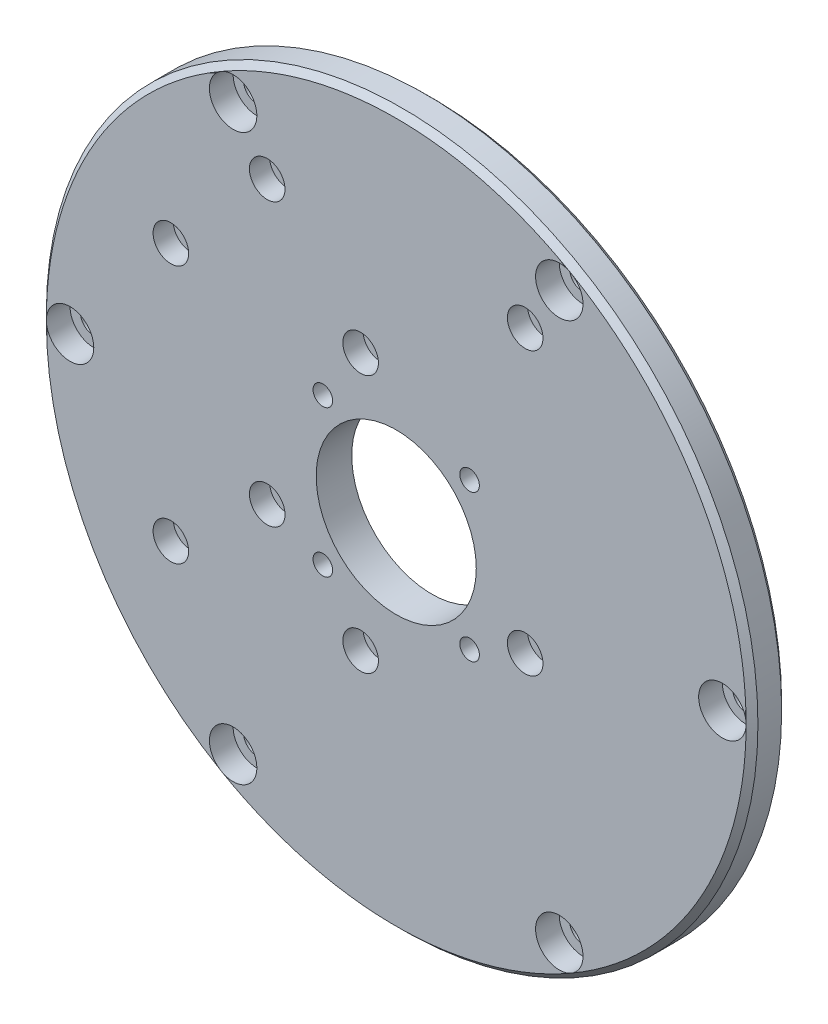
ISO-10303-21;
HEADER;
FILE_DESCRIPTION(('STEP AP214'),'2;1');
FILE_NAME('part.step','',(''),(''),'','','');
FILE_SCHEMA(('AUTOMOTIVE_DESIGN { 1 0 10303 214 1 1 1 1 }'));
ENDSEC;
DATA;
#1=APPLICATION_CONTEXT('core data for automotive mechanical design processes');
#2=APPLICATION_PROTOCOL_DEFINITION('international standard','automotive_design',2000,#1);
#3=PRODUCT_CONTEXT('',#1,'mechanical');
#4=PRODUCT('Part','Part','',(#3));
#5=PRODUCT_RELATED_PRODUCT_CATEGORY('part','',(#4));
#6=PRODUCT_DEFINITION_FORMATION('','',#4);
#7=PRODUCT_DEFINITION_CONTEXT('part definition',#1,'design');
#8=PRODUCT_DEFINITION('design','',#6,#7);
#9=PRODUCT_DEFINITION_SHAPE('','',#8);
#10=(LENGTH_UNIT() NAMED_UNIT(*) SI_UNIT(.MILLI.,.METRE.));
#11=(NAMED_UNIT(*) PLANE_ANGLE_UNIT() SI_UNIT($,.RADIAN.));
#12=(NAMED_UNIT(*) SI_UNIT($,.STERADIAN.) SOLID_ANGLE_UNIT());
#13=UNCERTAINTY_MEASURE_WITH_UNIT(LENGTH_MEASURE(1.E-05),#10,'distance_accuracy_value','');
#14=(GEOMETRIC_REPRESENTATION_CONTEXT(3) GLOBAL_UNCERTAINTY_ASSIGNED_CONTEXT((#13)) GLOBAL_UNIT_ASSIGNED_CONTEXT((#10,
#11,#12)) REPRESENTATION_CONTEXT('',''));
#15=CARTESIAN_POINT('',(0.,0.,0.));
#16=DIRECTION('',(0.,0.,1.));
#17=DIRECTION('',(1.,0.,0.));
#18=AXIS2_PLACEMENT_3D('',#15,#16,#17);
#19=CARTESIAN_POINT('',(-4.3,-21.75,2.6));
#20=DIRECTION('',(0.,0.,-1.));
#21=DIRECTION('',(0.,-1.,0.));
#22=AXIS2_PLACEMENT_3D('',#19,#20,#21);
#23=PLANE('',#22);
#24=CARTESIAN_POINT('',(-6.,-21.75,2.6));
#25=DIRECTION('',(0.,0.,1.));
#26=DIRECTION('',(1.,0.,0.));
#27=AXIS2_PLACEMENT_3D('',#24,#25,#26);
#28=CIRCLE('',#27,1.7);
#29=CARTESIAN_POINT('',(-4.3,-21.75,2.6));
#30=VERTEX_POINT('',#29);
#31=EDGE_CURVE('E591',#30,#30,#28,.T.);
#32=ORIENTED_EDGE('',*,*,#31,.F.);
#33=EDGE_LOOP('',(#32));
#34=FACE_BOUND('',#33,.T.);
#35=CARTESIAN_POINT('',(-6.,-21.75,2.6));
#36=DIRECTION('',(0.,0.,1.));
#37=DIRECTION('',(1.,0.,0.));
#38=AXIS2_PLACEMENT_3D('',#35,#36,#37);
#39=CIRCLE('',#38,3.);
#40=CARTESIAN_POINT('',(-3.,-21.75,2.6));
#41=VERTEX_POINT('',#40);
#42=EDGE_CURVE('E1509',#41,#41,#39,.T.);
#43=ORIENTED_EDGE('',*,*,#42,.T.);
#44=EDGE_LOOP('',(#43));
#45=FACE_BOUND('',#44,.T.);
#46=ADVANCED_FACE('F17',(#34,#45),#23,.F.);
#47=CARTESIAN_POINT('',(-36.3,-21.75,2.6));
#48=DIRECTION('',(0.,0.,-1.));
#49=DIRECTION('',(0.,-1.,0.));
#50=AXIS2_PLACEMENT_3D('',#47,#48,#49);
#51=PLANE('',#50);
#52=CARTESIAN_POINT('',(-38.,-21.75,2.6));
#53=DIRECTION('',(0.,0.,1.));
#54=DIRECTION('',(1.,0.,0.));
#55=AXIS2_PLACEMENT_3D('',#52,#53,#54);
#56=CIRCLE('',#55,1.7);
#57=CARTESIAN_POINT('',(-36.3,-21.75,2.6));
#58=VERTEX_POINT('',#57);
#59=EDGE_CURVE('E575',#58,#58,#56,.T.);
#60=ORIENTED_EDGE('',*,*,#59,.F.);
#61=EDGE_LOOP('',(#60));
#62=FACE_BOUND('',#61,.T.);
#63=CARTESIAN_POINT('',(-38.,-21.75,2.6));
#64=DIRECTION('',(0.,0.,1.));
#65=DIRECTION('',(1.,0.,0.));
#66=AXIS2_PLACEMENT_3D('',#63,#64,#65);
#67=CIRCLE('',#66,3.);
#68=CARTESIAN_POINT('',(-35.,-21.75,2.6));
#69=VERTEX_POINT('',#68);
#70=EDGE_CURVE('E588',#69,#69,#67,.T.);
#71=ORIENTED_EDGE('',*,*,#70,.T.);
#72=EDGE_LOOP('',(#71));
#73=FACE_BOUND('',#72,.T.);
#74=ADVANCED_FACE('F370',(#62,#73),#51,.F.);
#75=CARTESIAN_POINT('',(-36.3,21.75,2.6));
#76=DIRECTION('',(0.,0.,-1.));
#77=DIRECTION('',(0.,-1.,0.));
#78=AXIS2_PLACEMENT_3D('',#75,#76,#77);
#79=PLANE('',#78);
#80=CARTESIAN_POINT('',(-38.,21.75,2.6));
#81=DIRECTION('',(0.,0.,1.));
#82=DIRECTION('',(1.,0.,0.));
#83=AXIS2_PLACEMENT_3D('',#80,#81,#82);
#84=CIRCLE('',#83,1.7);
#85=CARTESIAN_POINT('',(-36.3,21.75,2.6));
#86=VERTEX_POINT('',#85);
#87=EDGE_CURVE('E286',#86,#86,#84,.T.);
#88=ORIENTED_EDGE('',*,*,#87,.F.);
#89=EDGE_LOOP('',(#88));
#90=FACE_BOUND('',#89,.T.);
#91=CARTESIAN_POINT('',(-38.,21.75,2.6));
#92=DIRECTION('',(0.,0.,1.));
#93=DIRECTION('',(1.,0.,0.));
#94=AXIS2_PLACEMENT_3D('',#91,#92,#93);
#95=CIRCLE('',#94,3.);
#96=CARTESIAN_POINT('',(-35.,21.75,2.6));
#97=VERTEX_POINT('',#96);
#98=EDGE_CURVE('E341',#97,#97,#95,.T.);
#99=ORIENTED_EDGE('',*,*,#98,.T.);
#100=EDGE_LOOP('',(#99));
#101=FACE_BOUND('',#100,.T.);
#102=ADVANCED_FACE('F376',(#90,#101),#79,.F.);
#103=CARTESIAN_POINT('',(-4.3,21.75,2.6));
#104=DIRECTION('',(0.,0.,-1.));
#105=DIRECTION('',(0.,-1.,0.));
#106=AXIS2_PLACEMENT_3D('',#103,#104,#105);
#107=PLANE('',#106);
#108=CARTESIAN_POINT('',(-6.,21.75,2.6));
#109=DIRECTION('',(0.,0.,1.));
#110=DIRECTION('',(1.,0.,0.));
#111=AXIS2_PLACEMENT_3D('',#108,#109,#110);
#112=CIRCLE('',#111,1.7);
#113=CARTESIAN_POINT('',(-4.3,21.75,2.6));
#114=VERTEX_POINT('',#113);
#115=EDGE_CURVE('E309',#114,#114,#112,.T.);
#116=ORIENTED_EDGE('',*,*,#115,.F.);
#117=EDGE_LOOP('',(#116));
#118=FACE_BOUND('',#117,.T.);
#119=CARTESIAN_POINT('',(-6.,21.75,2.6));
#120=DIRECTION('',(0.,0.,1.));
#121=DIRECTION('',(1.,0.,0.));
#122=AXIS2_PLACEMENT_3D('',#119,#120,#121);
#123=CIRCLE('',#122,3.);
#124=CARTESIAN_POINT('',(-3.,21.75,2.6));
#125=VERTEX_POINT('',#124);
#126=EDGE_CURVE('E290',#125,#125,#123,.T.);
#127=ORIENTED_EDGE('',*,*,#126,.T.);
#128=EDGE_LOOP('',(#127));
#129=FACE_BOUND('',#128,.T.);
#130=ADVANCED_FACE('F19',(#118,#129),#107,.F.);
#131=CARTESIAN_POINT('',(23.45,-8.25000000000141,2.6));
#132=DIRECTION('',(0.,0.,-1.));
#133=DIRECTION('',(0.,-1.,0.));
#134=AXIS2_PLACEMENT_3D('',#131,#132,#133);
#135=PLANE('',#134);
#136=CARTESIAN_POINT('',(21.75,-8.25000000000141,2.6));
#137=DIRECTION('',(0.,0.,1.));
#138=DIRECTION('',(1.,0.,0.));
#139=AXIS2_PLACEMENT_3D('',#136,#137,#138);
#140=CIRCLE('',#139,1.7);
#141=CARTESIAN_POINT('',(23.45,-8.25000000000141,2.6));
#142=VERTEX_POINT('',#141);
#143=EDGE_CURVE('E171',#142,#142,#140,.T.);
#144=ORIENTED_EDGE('',*,*,#143,.F.);
#145=EDGE_LOOP('',(#144));
#146=FACE_BOUND('',#145,.T.);
#147=CARTESIAN_POINT('',(21.75,-8.25000000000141,2.6));
#148=DIRECTION('',(0.,0.,1.));
#149=DIRECTION('',(1.,0.,0.));
#150=AXIS2_PLACEMENT_3D('',#147,#148,#149);
#151=CIRCLE('',#150,3.);
#152=CARTESIAN_POINT('',(24.75,-8.25000000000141,2.6));
#153=VERTEX_POINT('',#152);
#154=EDGE_CURVE('E162',#153,#153,#151,.T.);
#155=ORIENTED_EDGE('',*,*,#154,.T.);
#156=EDGE_LOOP('',(#155));
#157=FACE_BOUND('',#156,.T.);
#158=ADVANCED_FACE('F398',(#146,#157),#135,.F.);
#159=CARTESIAN_POINT('',(-20.05,-8.25,2.6));
#160=DIRECTION('',(0.,0.,-1.));
#161=DIRECTION('',(0.,-1.,0.));
#162=AXIS2_PLACEMENT_3D('',#159,#160,#161);
#163=PLANE('',#162);
#164=CARTESIAN_POINT('',(-21.75,-8.25,2.6));
#165=DIRECTION('',(0.,0.,1.));
#166=DIRECTION('',(1.,0.,0.));
#167=AXIS2_PLACEMENT_3D('',#164,#165,#166);
#168=CIRCLE('',#167,1.7);
#169=CARTESIAN_POINT('',(-20.05,-8.25,2.6));
#170=VERTEX_POINT('',#169);
#171=EDGE_CURVE('E187',#170,#170,#168,.T.);
#172=ORIENTED_EDGE('',*,*,#171,.F.);
#173=EDGE_LOOP('',(#172));
#174=FACE_BOUND('',#173,.T.);
#175=CARTESIAN_POINT('',(-21.75,-8.25,2.6));
#176=DIRECTION('',(0.,0.,1.));
#177=DIRECTION('',(1.,0.,0.));
#178=AXIS2_PLACEMENT_3D('',#175,#176,#177);
#179=CIRCLE('',#178,3.);
#180=CARTESIAN_POINT('',(-18.75,-8.25,2.6));
#181=VERTEX_POINT('',#180);
#182=EDGE_CURVE('E180',#181,#181,#179,.T.);
#183=ORIENTED_EDGE('',*,*,#182,.T.);
#184=EDGE_LOOP('',(#183));
#185=FACE_BOUND('',#184,.T.);
#186=ADVANCED_FACE('F400',(#174,#185),#163,.F.);
#187=CARTESIAN_POINT('',(-20.05,39.25,2.6));
#188=DIRECTION('',(0.,0.,-1.));
#189=DIRECTION('',(0.,-1.,0.));
#190=AXIS2_PLACEMENT_3D('',#187,#188,#189);
#191=PLANE('',#190);
#192=CARTESIAN_POINT('',(-21.75,39.25,2.6));
#193=DIRECTION('',(0.,0.,1.));
#194=DIRECTION('',(1.,0.,0.));
#195=AXIS2_PLACEMENT_3D('',#192,#193,#194);
#196=CIRCLE('',#195,1.7);
#197=CARTESIAN_POINT('',(-20.05,39.25,2.6));
#198=VERTEX_POINT('',#197);
#199=EDGE_CURVE('E204',#198,#198,#196,.T.);
#200=ORIENTED_EDGE('',*,*,#199,.F.);
#201=EDGE_LOOP('',(#200));
#202=FACE_BOUND('',#201,.T.);
#203=CARTESIAN_POINT('',(-21.75,39.25,2.6));
#204=DIRECTION('',(0.,0.,1.));
#205=DIRECTION('',(1.,0.,0.));
#206=AXIS2_PLACEMENT_3D('',#203,#204,#205);
#207=CIRCLE('',#206,3.);
#208=CARTESIAN_POINT('',(-18.75,39.25,2.6));
#209=VERTEX_POINT('',#208);
#210=EDGE_CURVE('E191',#209,#209,#207,.T.);
#211=ORIENTED_EDGE('',*,*,#210,.T.);
#212=EDGE_LOOP('',(#211));
#213=FACE_BOUND('',#212,.T.);
#214=ADVANCED_FACE('F394',(#202,#213),#191,.F.);
#215=CARTESIAN_POINT('',(23.45,39.2499999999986,2.6));
#216=DIRECTION('',(0.,0.,-1.));
#217=DIRECTION('',(0.,-1.,0.));
#218=AXIS2_PLACEMENT_3D('',#215,#216,#217);
#219=PLANE('',#218);
#220=CARTESIAN_POINT('',(21.75,39.2499999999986,2.6));
#221=DIRECTION('',(0.,0.,1.));
#222=DIRECTION('',(1.,0.,0.));
#223=AXIS2_PLACEMENT_3D('',#220,#221,#222);
#224=CIRCLE('',#223,1.7);
#225=CARTESIAN_POINT('',(23.45,39.2499999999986,2.6));
#226=VERTEX_POINT('',#225);
#227=EDGE_CURVE('E229',#226,#226,#224,.T.);
#228=ORIENTED_EDGE('',*,*,#227,.F.);
#229=EDGE_LOOP('',(#228));
#230=FACE_BOUND('',#229,.T.);
#231=CARTESIAN_POINT('',(21.75,39.2499999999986,2.6));
#232=DIRECTION('',(0.,0.,1.));
#233=DIRECTION('',(1.,0.,0.));
#234=AXIS2_PLACEMENT_3D('',#231,#232,#233);
#235=CIRCLE('',#234,3.);
#236=CARTESIAN_POINT('',(24.75,39.2499999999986,2.6));
#237=VERTEX_POINT('',#236);
#238=EDGE_CURVE('E209',#237,#237,#235,.T.);
#239=ORIENTED_EDGE('',*,*,#238,.T.);
#240=EDGE_LOOP('',(#239));
#241=FACE_BOUND('',#240,.T.);
#242=ADVANCED_FACE('F391',(#230,#241),#219,.F.);
#243=CARTESIAN_POINT('',(-25.2500000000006,47.6313972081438,2.));
#244=DIRECTION('',(0.,0.,-1.));
#245=DIRECTION('',(0.,-1.,0.));
#246=AXIS2_PLACEMENT_3D('',#243,#244,#245);
#247=PLANE('',#246);
#248=CARTESIAN_POINT('',(-27.5000000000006,47.6313972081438,2.));
#249=DIRECTION('',(0.,0.,1.));
#250=DIRECTION('',(1.,0.,0.));
#251=AXIS2_PLACEMENT_3D('',#248,#249,#250);
#252=CIRCLE('',#251,2.25);
#253=CARTESIAN_POINT('',(-25.2500000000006,47.6313972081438,2.));
#254=VERTEX_POINT('',#253);
#255=EDGE_CURVE('E197',#254,#254,#252,.T.);
#256=ORIENTED_EDGE('',*,*,#255,.F.);
#257=EDGE_LOOP('',(#256));
#258=FACE_BOUND('',#257,.T.);
#259=CARTESIAN_POINT('',(-27.5000000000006,47.6313972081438,2.));
#260=DIRECTION('',(0.,0.,1.));
#261=DIRECTION('',(1.,0.,0.));
#262=AXIS2_PLACEMENT_3D('',#259,#260,#261);
#263=CIRCLE('',#262,4.);
#264=CARTESIAN_POINT('',(-23.5000000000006,47.6313972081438,2.));
#265=VERTEX_POINT('',#264);
#266=EDGE_CURVE('E220',#265,#265,#263,.T.);
#267=ORIENTED_EDGE('',*,*,#266,.T.);
#268=EDGE_LOOP('',(#267));
#269=FACE_BOUND('',#268,.T.);
#270=ADVANCED_FACE('F389',(#258,#269),#247,.F.);
#271=CARTESIAN_POINT('',(29.7499999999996,47.6313972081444,2.));
#272=DIRECTION('',(0.,0.,-1.));
#273=DIRECTION('',(0.,-1.,0.));
#274=AXIS2_PLACEMENT_3D('',#271,#272,#273);
#275=PLANE('',#274);
#276=CARTESIAN_POINT('',(27.4999999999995,47.6313972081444,2.));
#277=DIRECTION('',(0.,0.,1.));
#278=DIRECTION('',(1.,0.,0.));
#279=AXIS2_PLACEMENT_3D('',#276,#277,#278);
#280=CIRCLE('',#279,2.25);
#281=CARTESIAN_POINT('',(29.7499999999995,47.6313972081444,2.));
#282=VERTEX_POINT('',#281);
#283=EDGE_CURVE('E80',#282,#282,#280,.T.);
#284=ORIENTED_EDGE('',*,*,#283,.F.);
#285=EDGE_LOOP('',(#284));
#286=FACE_BOUND('',#285,.T.);
#287=CARTESIAN_POINT('',(27.4999999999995,47.6313972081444,2.));
#288=DIRECTION('',(0.,0.,1.));
#289=DIRECTION('',(1.,0.,0.));
#290=AXIS2_PLACEMENT_3D('',#287,#288,#289);
#291=CIRCLE('',#290,4.);
#292=CARTESIAN_POINT('',(31.4999999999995,47.6313972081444,2.));
#293=VERTEX_POINT('',#292);
#294=EDGE_CURVE('E201',#293,#293,#291,.T.);
#295=ORIENTED_EDGE('',*,*,#294,.T.);
#296=EDGE_LOOP('',(#295));
#297=FACE_BOUND('',#296,.T.);
#298=ADVANCED_FACE('F385',(#286,#297),#275,.F.);
#299=CARTESIAN_POINT('',(57.25,0.,2.));
#300=DIRECTION('',(0.,0.,-1.));
#301=DIRECTION('',(0.,-1.,0.));
#302=AXIS2_PLACEMENT_3D('',#299,#300,#301);
#303=PLANE('',#302);
#304=CARTESIAN_POINT('',(55.,0.,2.));
#305=DIRECTION('',(0.,0.,1.));
#306=DIRECTION('',(1.,0.,0.));
#307=AXIS2_PLACEMENT_3D('',#304,#305,#306);
#308=CIRCLE('',#307,2.25);
#309=CARTESIAN_POINT('',(57.25,0.,2.));
#310=VERTEX_POINT('',#309);
#311=EDGE_CURVE('E77',#310,#310,#308,.T.);
#312=ORIENTED_EDGE('',*,*,#311,.F.);
#313=EDGE_LOOP('',(#312));
#314=FACE_BOUND('',#313,.T.);
#315=CARTESIAN_POINT('',(55.,0.,2.));
#316=DIRECTION('',(0.,0.,1.));
#317=DIRECTION('',(1.,0.,0.));
#318=AXIS2_PLACEMENT_3D('',#315,#316,#317);
#319=CIRCLE('',#318,4.);
#320=CARTESIAN_POINT('',(59.,0.,2.));
#321=VERTEX_POINT('',#320);
#322=EDGE_CURVE('E70',#321,#321,#319,.T.);
#323=ORIENTED_EDGE('',*,*,#322,.T.);
#324=EDGE_LOOP('',(#323));
#325=FACE_BOUND('',#324,.T.);
#326=ADVANCED_FACE('F388',(#314,#325),#303,.F.);
#327=CARTESIAN_POINT('',(29.75,-47.631397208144,2.));
#328=DIRECTION('',(0.,0.,-1.));
#329=DIRECTION('',(0.,-1.,0.));
#330=AXIS2_PLACEMENT_3D('',#327,#328,#329);
#331=PLANE('',#330);
#332=CARTESIAN_POINT('',(27.5,-47.631397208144,2.));
#333=DIRECTION('',(0.,0.,1.));
#334=DIRECTION('',(1.,0.,0.));
#335=AXIS2_PLACEMENT_3D('',#332,#333,#334);
#336=CIRCLE('',#335,2.25);
#337=CARTESIAN_POINT('',(29.75,-47.631397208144,2.));
#338=VERTEX_POINT('',#337);
#339=EDGE_CURVE('E95',#338,#338,#336,.T.);
#340=ORIENTED_EDGE('',*,*,#339,.F.);
#341=EDGE_LOOP('',(#340));
#342=FACE_BOUND('',#341,.T.);
#343=CARTESIAN_POINT('',(27.5,-47.631397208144,2.));
#344=DIRECTION('',(0.,0.,1.));
#345=DIRECTION('',(1.,0.,0.));
#346=AXIS2_PLACEMENT_3D('',#343,#344,#345);
#347=CIRCLE('',#346,4.);
#348=CARTESIAN_POINT('',(31.5,-47.631397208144,2.));
#349=VERTEX_POINT('',#348);
#350=EDGE_CURVE('E91',#349,#349,#347,.T.);
#351=ORIENTED_EDGE('',*,*,#350,.T.);
#352=EDGE_LOOP('',(#351));
#353=FACE_BOUND('',#352,.T.);
#354=ADVANCED_FACE('F383',(#342,#353),#331,.F.);
#355=CARTESIAN_POINT('',(-25.25,-47.6313972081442,2.));
#356=DIRECTION('',(0.,0.,-1.));
#357=DIRECTION('',(0.,-1.,0.));
#358=AXIS2_PLACEMENT_3D('',#355,#356,#357);
#359=PLANE('',#358);
#360=CARTESIAN_POINT('',(-27.5,-47.6313972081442,2.));
#361=DIRECTION('',(0.,0.,1.));
#362=DIRECTION('',(1.,0.,0.));
#363=AXIS2_PLACEMENT_3D('',#360,#361,#362);
#364=CIRCLE('',#363,2.25);
#365=CARTESIAN_POINT('',(-25.25,-47.6313972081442,2.));
#366=VERTEX_POINT('',#365);
#367=EDGE_CURVE('E103',#366,#366,#364,.T.);
#368=ORIENTED_EDGE('',*,*,#367,.F.);
#369=EDGE_LOOP('',(#368));
#370=FACE_BOUND('',#369,.T.);
#371=CARTESIAN_POINT('',(-27.5,-47.6313972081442,2.));
#372=DIRECTION('',(0.,0.,1.));
#373=DIRECTION('',(1.,0.,0.));
#374=AXIS2_PLACEMENT_3D('',#371,#372,#373);
#375=CIRCLE('',#374,4.);
#376=CARTESIAN_POINT('',(-23.5,-47.6313972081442,2.));
#377=VERTEX_POINT('',#376);
#378=EDGE_CURVE('E99',#377,#377,#375,.T.);
#379=ORIENTED_EDGE('',*,*,#378,.T.);
#380=EDGE_LOOP('',(#379));
#381=FACE_BOUND('',#380,.T.);
#382=ADVANCED_FACE('F516',(#370,#381),#359,.F.);
#383=CARTESIAN_POINT('',(-52.75,0.,2.));
#384=DIRECTION('',(0.,0.,-1.));
#385=DIRECTION('',(0.,-1.,0.));
#386=AXIS2_PLACEMENT_3D('',#383,#384,#385);
#387=PLANE('',#386);
#388=CARTESIAN_POINT('',(-55.,0.,2.));
#389=DIRECTION('',(0.,0.,1.));
#390=DIRECTION('',(1.,0.,0.));
#391=AXIS2_PLACEMENT_3D('',#388,#389,#390);
#392=CIRCLE('',#391,2.25);
#393=CARTESIAN_POINT('',(-52.75,0.,2.));
#394=VERTEX_POINT('',#393);
#395=EDGE_CURVE('E116',#394,#394,#392,.T.);
#396=ORIENTED_EDGE('',*,*,#395,.F.);
#397=EDGE_LOOP('',(#396));
#398=FACE_BOUND('',#397,.T.);
#399=CARTESIAN_POINT('',(-55.,0.,2.));
#400=DIRECTION('',(0.,0.,1.));
#401=DIRECTION('',(1.,0.,0.));
#402=AXIS2_PLACEMENT_3D('',#399,#400,#401);
#403=CIRCLE('',#402,4.);
#404=CARTESIAN_POINT('',(-51.,0.,2.));
#405=VERTEX_POINT('',#404);
#406=EDGE_CURVE('E107',#405,#405,#403,.T.);
#407=ORIENTED_EDGE('',*,*,#406,.T.);
#408=EDGE_LOOP('',(#407));
#409=FACE_BOUND('',#408,.T.);
#410=ADVANCED_FACE('F511',(#398,#409),#387,.F.);
#411=CARTESIAN_POINT('',(0.,0.,0.));
#412=DIRECTION('',(0.,0.,1.));
#413=DIRECTION('',(1.,0.,0.));
#414=AXIS2_PLACEMENT_3D('',#411,#412,#413);
#415=PLANE('',#414);
#416=CARTESIAN_POINT('',(0.,0.,0.));
#417=DIRECTION('',(0.,0.,1.));
#418=DIRECTION('',(1.,0.,0.));
#419=AXIS2_PLACEMENT_3D('',#416,#417,#418);
#420=CIRCLE('',#419,13.5);
#421=CARTESIAN_POINT('',(13.5,0.,0.));
#422=VERTEX_POINT('',#421);
#423=EDGE_CURVE('E124',#422,#422,#420,.T.);
#424=ORIENTED_EDGE('',*,*,#423,.T.);
#425=EDGE_LOOP('',(#424));
#426=FACE_BOUND('',#425,.T.);
#427=CARTESIAN_POINT('',(-55.,0.,0.));
#428=DIRECTION('',(0.,0.,1.));
#429=DIRECTION('',(1.,0.,0.));
#430=AXIS2_PLACEMENT_3D('',#427,#428,#429);
#431=CIRCLE('',#430,2.25);
#432=CARTESIAN_POINT('',(-52.75,0.,0.));
#433=VERTEX_POINT('',#432);
#434=EDGE_CURVE('E112',#433,#433,#431,.T.);
#435=ORIENTED_EDGE('',*,*,#434,.T.);
#436=EDGE_LOOP('',(#435));
#437=FACE_BOUND('',#436,.T.);
#438=CARTESIAN_POINT('',(-27.5,-47.6313972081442,0.));
#439=DIRECTION('',(0.,0.,1.));
#440=DIRECTION('',(1.,0.,0.));
#441=AXIS2_PLACEMENT_3D('',#438,#439,#440);
#442=CIRCLE('',#441,2.25);
#443=CARTESIAN_POINT('',(-25.25,-47.6313972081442,0.));
#444=VERTEX_POINT('',#443);
#445=EDGE_CURVE('E98',#444,#444,#442,.T.);
#446=ORIENTED_EDGE('',*,*,#445,.T.);
#447=EDGE_LOOP('',(#446));
#448=FACE_BOUND('',#447,.T.);
#449=CARTESIAN_POINT('',(27.5,-47.631397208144,0.));
#450=DIRECTION('',(0.,0.,1.));
#451=DIRECTION('',(1.,0.,0.));
#452=AXIS2_PLACEMENT_3D('',#449,#450,#451);
#453=CIRCLE('',#452,2.25);
#454=CARTESIAN_POINT('',(29.75,-47.631397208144,0.));
#455=VERTEX_POINT('',#454);
#456=EDGE_CURVE('E90',#455,#455,#453,.T.);
#457=ORIENTED_EDGE('',*,*,#456,.T.);
#458=EDGE_LOOP('',(#457));
#459=FACE_BOUND('',#458,.T.);
#460=CARTESIAN_POINT('',(55.,0.,0.));
#461=DIRECTION('',(0.,0.,1.));
#462=DIRECTION('',(1.,0.,0.));
#463=AXIS2_PLACEMENT_3D('',#460,#461,#462);
#464=CIRCLE('',#463,2.25);
#465=CARTESIAN_POINT('',(57.25,0.,0.));
#466=VERTEX_POINT('',#465);
#467=EDGE_CURVE('E69',#466,#466,#464,.T.);
#468=ORIENTED_EDGE('',*,*,#467,.T.);
#469=EDGE_LOOP('',(#468));
#470=FACE_BOUND('',#469,.T.);
#471=CARTESIAN_POINT('',(27.4999999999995,47.6313972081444,0.));
#472=DIRECTION('',(0.,0.,1.));
#473=DIRECTION('',(1.,0.,0.));
#474=AXIS2_PLACEMENT_3D('',#471,#472,#473);
#475=CIRCLE('',#474,2.25);
#476=CARTESIAN_POINT('',(29.7499999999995,47.6313972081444,0.));
#477=VERTEX_POINT('',#476);
#478=EDGE_CURVE('E154',#477,#477,#475,.T.);
#479=ORIENTED_EDGE('',*,*,#478,.T.);
#480=EDGE_LOOP('',(#479));
#481=FACE_BOUND('',#480,.T.);
#482=CARTESIAN_POINT('',(-27.5000000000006,47.6313972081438,0.));
#483=DIRECTION('',(0.,0.,1.));
#484=DIRECTION('',(1.,0.,0.));
#485=AXIS2_PLACEMENT_3D('',#482,#483,#484);
#486=CIRCLE('',#485,2.25);
#487=CARTESIAN_POINT('',(-25.2500000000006,47.6313972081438,0.));
#488=VERTEX_POINT('',#487);
#489=EDGE_CURVE('E84',#488,#488,#486,.T.);
#490=ORIENTED_EDGE('',*,*,#489,.T.);
#491=EDGE_LOOP('',(#490));
#492=FACE_BOUND('',#491,.T.);
#493=CARTESIAN_POINT('',(21.75,39.2499999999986,0.));
#494=DIRECTION('',(0.,0.,1.));
#495=DIRECTION('',(1.,0.,0.));
#496=AXIS2_PLACEMENT_3D('',#493,#494,#495);
#497=CIRCLE('',#496,1.7);
#498=CARTESIAN_POINT('',(23.45,39.2499999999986,0.));
#499=VERTEX_POINT('',#498);
#500=EDGE_CURVE('E216',#499,#499,#497,.T.);
#501=ORIENTED_EDGE('',*,*,#500,.T.);
#502=EDGE_LOOP('',(#501));
#503=FACE_BOUND('',#502,.T.);
#504=CARTESIAN_POINT('',(-21.75,39.25,0.));
#505=DIRECTION('',(0.,0.,1.));
#506=DIRECTION('',(1.,0.,0.));
#507=AXIS2_PLACEMENT_3D('',#504,#505,#506);
#508=CIRCLE('',#507,1.7);
#509=CARTESIAN_POINT('',(-20.05,39.25,0.));
#510=VERTEX_POINT('',#509);
#511=EDGE_CURVE('E196',#510,#510,#508,.T.);
#512=ORIENTED_EDGE('',*,*,#511,.T.);
#513=EDGE_LOOP('',(#512));
#514=FACE_BOUND('',#513,.T.);
#515=CARTESIAN_POINT('',(-21.75,-8.25,0.));
#516=DIRECTION('',(0.,0.,1.));
#517=DIRECTION('',(1.,0.,0.));
#518=AXIS2_PLACEMENT_3D('',#515,#516,#517);
#519=CIRCLE('',#518,1.7);
#520=CARTESIAN_POINT('',(-20.05,-8.25,0.));
#521=VERTEX_POINT('',#520);
#522=EDGE_CURVE('E179',#521,#521,#519,.T.);
#523=ORIENTED_EDGE('',*,*,#522,.T.);
#524=EDGE_LOOP('',(#523));
#525=FACE_BOUND('',#524,.T.);
#526=CARTESIAN_POINT('',(21.75,-8.25000000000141,0.));
#527=DIRECTION('',(0.,0.,1.));
#528=DIRECTION('',(1.,0.,0.));
#529=AXIS2_PLACEMENT_3D('',#526,#527,#528);
#530=CIRCLE('',#529,1.7);
#531=CARTESIAN_POINT('',(23.45,-8.25000000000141,0.));
#532=VERTEX_POINT('',#531);
#533=EDGE_CURVE('E167',#532,#532,#530,.T.);
#534=ORIENTED_EDGE('',*,*,#533,.T.);
#535=EDGE_LOOP('',(#534));
#536=FACE_BOUND('',#535,.T.);
#537=CARTESIAN_POINT('',(12.3743686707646,12.3743686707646,0.));
#538=DIRECTION('',(0.,0.,1.));
#539=DIRECTION('',(1.,0.,0.));
#540=AXIS2_PLACEMENT_3D('',#537,#538,#539);
#541=CIRCLE('',#540,1.65);
#542=CARTESIAN_POINT('',(14.0243686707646,12.3743686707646,0.));
#543=VERTEX_POINT('',#542);
#544=EDGE_CURVE('E156',#543,#543,#541,.T.);
#545=ORIENTED_EDGE('',*,*,#544,.T.);
#546=EDGE_LOOP('',(#545));
#547=FACE_BOUND('',#546,.T.);
#548=CARTESIAN_POINT('',(12.3743686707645,-12.3743686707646,0.));
#549=DIRECTION('',(0.,0.,1.));
#550=DIRECTION('',(1.,0.,0.));
#551=AXIS2_PLACEMENT_3D('',#548,#549,#550);
#552=CIRCLE('',#551,1.65);
#553=CARTESIAN_POINT('',(14.0243686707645,-12.3743686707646,0.));
#554=VERTEX_POINT('',#553);
#555=EDGE_CURVE('E269',#554,#554,#552,.T.);
#556=ORIENTED_EDGE('',*,*,#555,.T.);
#557=EDGE_LOOP('',(#556));
#558=FACE_BOUND('',#557,.T.);
#559=CARTESIAN_POINT('',(-12.3743686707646,-12.3743686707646,0.));
#560=DIRECTION('',(0.,0.,1.));
#561=DIRECTION('',(1.,0.,0.));
#562=AXIS2_PLACEMENT_3D('',#559,#560,#561);
#563=CIRCLE('',#562,1.65);
#564=CARTESIAN_POINT('',(-10.7243686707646,-12.3743686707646,0.));
#565=VERTEX_POINT('',#564);
#566=EDGE_CURVE('E262',#565,#565,#563,.T.);
#567=ORIENTED_EDGE('',*,*,#566,.T.);
#568=EDGE_LOOP('',(#567));
#569=FACE_BOUND('',#568,.T.);
#570=CARTESIAN_POINT('',(-12.3743686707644,12.3743686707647,0.));
#571=DIRECTION('',(0.,0.,1.));
#572=DIRECTION('',(1.,0.,0.));
#573=AXIS2_PLACEMENT_3D('',#570,#571,#572);
#574=CIRCLE('',#573,1.65);
#575=CARTESIAN_POINT('',(-10.7243686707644,12.3743686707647,0.));
#576=VERTEX_POINT('',#575);
#577=EDGE_CURVE('E257',#576,#576,#574,.T.);
#578=ORIENTED_EDGE('',*,*,#577,.T.);
#579=EDGE_LOOP('',(#578));
#580=FACE_BOUND('',#579,.T.);
#581=CARTESIAN_POINT('',(-6.,21.75,0.));
#582=DIRECTION('',(0.,0.,1.));
#583=DIRECTION('',(1.,0.,0.));
#584=AXIS2_PLACEMENT_3D('',#581,#582,#583);
#585=CIRCLE('',#584,1.7);
#586=CARTESIAN_POINT('',(-4.3,21.75,0.));
#587=VERTEX_POINT('',#586);
#588=EDGE_CURVE('E302',#587,#587,#585,.T.);
#589=ORIENTED_EDGE('',*,*,#588,.T.);
#590=EDGE_LOOP('',(#589));
#591=FACE_BOUND('',#590,.T.);
#592=CARTESIAN_POINT('',(-38.,21.75,0.));
#593=DIRECTION('',(0.,0.,1.));
#594=DIRECTION('',(1.,0.,0.));
#595=AXIS2_PLACEMENT_3D('',#592,#593,#594);
#596=CIRCLE('',#595,1.7);
#597=CARTESIAN_POINT('',(-36.3,21.75,0.));
#598=VERTEX_POINT('',#597);
#599=EDGE_CURVE('E291',#598,#598,#596,.T.);
#600=ORIENTED_EDGE('',*,*,#599,.T.);
#601=EDGE_LOOP('',(#600));
#602=FACE_BOUND('',#601,.T.);
#603=CARTESIAN_POINT('',(-38.,-21.75,0.));
#604=DIRECTION('',(0.,0.,1.));
#605=DIRECTION('',(1.,0.,0.));
#606=AXIS2_PLACEMENT_3D('',#603,#604,#605);
#607=CIRCLE('',#606,1.7);
#608=CARTESIAN_POINT('',(-36.3,-21.75,0.));
#609=VERTEX_POINT('',#608);
#610=EDGE_CURVE('E578',#609,#609,#607,.T.);
#611=ORIENTED_EDGE('',*,*,#610,.T.);
#612=EDGE_LOOP('',(#611));
#613=FACE_BOUND('',#612,.T.);
#614=CARTESIAN_POINT('',(-6.,-21.75,0.));
#615=DIRECTION('',(0.,0.,1.));
#616=DIRECTION('',(1.,0.,0.));
#617=AXIS2_PLACEMENT_3D('',#614,#615,#616);
#618=CIRCLE('',#617,1.7);
#619=CARTESIAN_POINT('',(-4.3,-21.75,0.));
#620=VERTEX_POINT('',#619);
#621=EDGE_CURVE('E627',#620,#620,#618,.T.);
#622=ORIENTED_EDGE('',*,*,#621,.T.);
#623=EDGE_LOOP('',(#622));
#624=FACE_BOUND('',#623,.T.);
#625=CARTESIAN_POINT('',(0.,0.,0.));
#626=DIRECTION('',(0.,0.,-1.));
#627=DIRECTION('',(1.,0.,0.));
#628=AXIS2_PLACEMENT_3D('',#625,#626,#627);
#629=CIRCLE('',#628,59.);
#630=CARTESIAN_POINT('',(59.,0.,0.));
#631=VERTEX_POINT('',#630);
#632=EDGE_CURVE('E249',#631,#631,#629,.T.);
#633=ORIENTED_EDGE('',*,*,#632,.T.);
#634=EDGE_LOOP('',(#633));
#635=FACE_BOUND('',#634,.T.);
#636=ADVANCED_FACE('F348',(#426,#437,#448,#459,#470,#481,#492,#503,#514,#525,#536,#547,#558,
#569,#580,#591,#602,#613,#624,#635),#415,.F.);
#637=CARTESIAN_POINT('',(0.,0.,6.));
#638=DIRECTION('',(0.,0.,1.));
#639=DIRECTION('',(1.,0.,0.));
#640=AXIS2_PLACEMENT_3D('',#637,#638,#639);
#641=PLANE('',#640);
#642=CARTESIAN_POINT('',(0.,0.,6.));
#643=DIRECTION('',(0.,0.,1.));
#644=DIRECTION('',(1.,0.,0.));
#645=AXIS2_PLACEMENT_3D('',#642,#643,#644);
#646=CIRCLE('',#645,13.5);
#647=CARTESIAN_POINT('',(13.5,0.,6.));
#648=VERTEX_POINT('',#647);
#649=EDGE_CURVE('E120',#648,#648,#646,.T.);
#650=ORIENTED_EDGE('',*,*,#649,.F.);
#651=EDGE_LOOP('',(#650));
#652=FACE_BOUND('',#651,.T.);
#653=CARTESIAN_POINT('',(21.75,39.2499999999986,6.));
#654=DIRECTION('',(0.,0.,1.));
#655=DIRECTION('',(1.,0.,0.));
#656=AXIS2_PLACEMENT_3D('',#653,#654,#655);
#657=CIRCLE('',#656,3.);
#658=CARTESIAN_POINT('',(24.75,39.2499999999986,6.));
#659=VERTEX_POINT('',#658);
#660=EDGE_CURVE('E213',#659,#659,#657,.T.);
#661=ORIENTED_EDGE('',*,*,#660,.F.);
#662=EDGE_LOOP('',(#661));
#663=FACE_BOUND('',#662,.T.);
#664=CARTESIAN_POINT('',(-21.75,39.25,6.));
#665=DIRECTION('',(0.,0.,1.));
#666=DIRECTION('',(1.,0.,0.));
#667=AXIS2_PLACEMENT_3D('',#664,#665,#666);
#668=CIRCLE('',#667,3.);
#669=CARTESIAN_POINT('',(-18.75,39.25,6.));
#670=VERTEX_POINT('',#669);
#671=EDGE_CURVE('E192',#670,#670,#668,.T.);
#672=ORIENTED_EDGE('',*,*,#671,.F.);
#673=EDGE_LOOP('',(#672));
#674=FACE_BOUND('',#673,.T.);
#675=CARTESIAN_POINT('',(-21.75,-8.25,6.));
#676=DIRECTION('',(0.,0.,1.));
#677=DIRECTION('',(1.,0.,0.));
#678=AXIS2_PLACEMENT_3D('',#675,#676,#677);
#679=CIRCLE('',#678,3.);
#680=CARTESIAN_POINT('',(-18.75,-8.25,6.));
#681=VERTEX_POINT('',#680);
#682=EDGE_CURVE('E175',#681,#681,#679,.T.);
#683=ORIENTED_EDGE('',*,*,#682,.F.);
#684=EDGE_LOOP('',(#683));
#685=FACE_BOUND('',#684,.T.);
#686=CARTESIAN_POINT('',(21.75,-8.25000000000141,6.));
#687=DIRECTION('',(0.,0.,1.));
#688=DIRECTION('',(1.,0.,0.));
#689=AXIS2_PLACEMENT_3D('',#686,#687,#688);
#690=CIRCLE('',#689,3.);
#691=CARTESIAN_POINT('',(24.75,-8.25000000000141,6.));
#692=VERTEX_POINT('',#691);
#693=EDGE_CURVE('E166',#692,#692,#690,.T.);
#694=ORIENTED_EDGE('',*,*,#693,.F.);
#695=EDGE_LOOP('',(#694));
#696=FACE_BOUND('',#695,.T.);
#697=CARTESIAN_POINT('',(12.3743686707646,12.3743686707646,6.));
#698=DIRECTION('',(0.,0.,1.));
#699=DIRECTION('',(1.,0.,0.));
#700=AXIS2_PLACEMENT_3D('',#697,#698,#699);
#701=CIRCLE('',#700,1.65);
#702=CARTESIAN_POINT('',(14.0243686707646,12.3743686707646,6.));
#703=VERTEX_POINT('',#702);
#704=EDGE_CURVE('E160',#703,#703,#701,.T.);
#705=ORIENTED_EDGE('',*,*,#704,.F.);
#706=EDGE_LOOP('',(#705));
#707=FACE_BOUND('',#706,.T.);
#708=CARTESIAN_POINT('',(12.3743686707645,-12.3743686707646,6.));
#709=DIRECTION('',(0.,0.,1.));
#710=DIRECTION('',(1.,0.,0.));
#711=AXIS2_PLACEMENT_3D('',#708,#709,#710);
#712=CIRCLE('',#711,1.65);
#713=CARTESIAN_POINT('',(14.0243686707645,-12.3743686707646,6.));
#714=VERTEX_POINT('',#713);
#715=EDGE_CURVE('E161',#714,#714,#712,.T.);
#716=ORIENTED_EDGE('',*,*,#715,.F.);
#717=EDGE_LOOP('',(#716));
#718=FACE_BOUND('',#717,.T.);
#719=CARTESIAN_POINT('',(-12.3743686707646,-12.3743686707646,6.));
#720=DIRECTION('',(0.,0.,1.));
#721=DIRECTION('',(1.,0.,0.));
#722=AXIS2_PLACEMENT_3D('',#719,#720,#721);
#723=CIRCLE('',#722,1.65);
#724=CARTESIAN_POINT('',(-10.7243686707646,-12.3743686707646,6.));
#725=VERTEX_POINT('',#724);
#726=EDGE_CURVE('E266',#725,#725,#723,.T.);
#727=ORIENTED_EDGE('',*,*,#726,.F.);
#728=EDGE_LOOP('',(#727));
#729=FACE_BOUND('',#728,.T.);
#730=CARTESIAN_POINT('',(-12.3743686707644,12.3743686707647,6.));
#731=DIRECTION('',(0.,0.,1.));
#732=DIRECTION('',(1.,0.,0.));
#733=AXIS2_PLACEMENT_3D('',#730,#731,#732);
#734=CIRCLE('',#733,1.65);
#735=CARTESIAN_POINT('',(-10.7243686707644,12.3743686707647,6.));
#736=VERTEX_POINT('',#735);
#737=EDGE_CURVE('E258',#736,#736,#734,.T.);
#738=ORIENTED_EDGE('',*,*,#737,.F.);
#739=EDGE_LOOP('',(#738));
#740=FACE_BOUND('',#739,.T.);
#741=CARTESIAN_POINT('',(-6.,21.75,6.));
#742=DIRECTION('',(0.,0.,1.));
#743=DIRECTION('',(1.,0.,0.));
#744=AXIS2_PLACEMENT_3D('',#741,#742,#743);
#745=CIRCLE('',#744,3.);
#746=CARTESIAN_POINT('',(-3.,21.75,6.));
#747=VERTEX_POINT('',#746);
#748=EDGE_CURVE('E295',#747,#747,#745,.T.);
#749=ORIENTED_EDGE('',*,*,#748,.F.);
#750=EDGE_LOOP('',(#749));
#751=FACE_BOUND('',#750,.T.);
#752=CARTESIAN_POINT('',(-38.,21.75,6.));
#753=DIRECTION('',(0.,0.,1.));
#754=DIRECTION('',(1.,0.,0.));
#755=AXIS2_PLACEMENT_3D('',#752,#753,#754);
#756=CIRCLE('',#755,3.);
#757=CARTESIAN_POINT('',(-35.,21.75,6.));
#758=VERTEX_POINT('',#757);
#759=EDGE_CURVE('E338',#758,#758,#756,.T.);
#760=ORIENTED_EDGE('',*,*,#759,.F.);
#761=EDGE_LOOP('',(#760));
#762=FACE_BOUND('',#761,.T.);
#763=CARTESIAN_POINT('',(-38.,-21.75,6.));
#764=DIRECTION('',(0.,0.,1.));
#765=DIRECTION('',(1.,0.,0.));
#766=AXIS2_PLACEMENT_3D('',#763,#764,#765);
#767=CIRCLE('',#766,3.);
#768=CARTESIAN_POINT('',(-35.,-21.75,6.));
#769=VERTEX_POINT('',#768);
#770=EDGE_CURVE('E580',#769,#769,#767,.T.);
#771=ORIENTED_EDGE('',*,*,#770,.F.);
#772=EDGE_LOOP('',(#771));
#773=FACE_BOUND('',#772,.T.);
#774=CARTESIAN_POINT('',(-6.,-21.75,6.));
#775=DIRECTION('',(0.,0.,1.));
#776=DIRECTION('',(1.,0.,0.));
#777=AXIS2_PLACEMENT_3D('',#774,#775,#776);
#778=CIRCLE('',#777,3.);
#779=CARTESIAN_POINT('',(-3.,-21.75,6.));
#780=VERTEX_POINT('',#779);
#781=EDGE_CURVE('E617',#780,#780,#778,.T.);
#782=ORIENTED_EDGE('',*,*,#781,.F.);
#783=EDGE_LOOP('',(#782));
#784=FACE_BOUND('',#783,.T.);
#785=CARTESIAN_POINT('',(55.,0.,6.));
#786=DIRECTION('',(0.,0.,1.));
#787=DIRECTION('',(1.,0.,0.));
#788=AXIS2_PLACEMENT_3D('',#785,#786,#787);
#789=CIRCLE('',#788,4.);
#790=CARTESIAN_POINT('',(59.,0.,6.));
#791=VERTEX_POINT('',#790);
#792=EDGE_CURVE('E62',#791,#791,#789,.T.);
#793=ORIENTED_EDGE('',*,*,#792,.F.);
#794=CARTESIAN_POINT('',(0.,0.,6.));
#795=DIRECTION('',(0.,0.,1.));
#796=DIRECTION('',(1.,0.,0.));
#797=AXIS2_PLACEMENT_3D('',#794,#795,#796);
#798=CIRCLE('',#797,59.);
#799=CARTESIAN_POINT('',(29.4999999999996,51.0954988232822,6.));
#800=VERTEX_POINT('',#799);
#801=EDGE_CURVE('E65',#791,#800,#798,.T.);
#802=ORIENTED_EDGE('',*,*,#801,.T.);
#803=CARTESIAN_POINT('',(27.4999999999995,47.6313972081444,6.));
#804=DIRECTION('',(0.,0.,1.));
#805=DIRECTION('',(1.,0.,0.));
#806=AXIS2_PLACEMENT_3D('',#803,#804,#805);
#807=CIRCLE('',#806,4.);
#808=EDGE_CURVE('E316',#800,#800,#807,.T.);
#809=ORIENTED_EDGE('',*,*,#808,.F.);
#810=CARTESIAN_POINT('',(0.,0.,6.));
#811=DIRECTION('',(0.,0.,1.));
#812=DIRECTION('',(1.,0.,0.));
#813=AXIS2_PLACEMENT_3D('',#810,#811,#812);
#814=CIRCLE('',#813,59.);
#815=CARTESIAN_POINT('',(-29.5000000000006,51.0954988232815,6.));
#816=VERTEX_POINT('',#815);
#817=EDGE_CURVE('E244',#800,#816,#814,.T.);
#818=ORIENTED_EDGE('',*,*,#817,.T.);
#819=CARTESIAN_POINT('',(-27.5000000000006,47.6313972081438,6.));
#820=DIRECTION('',(0.,0.,1.));
#821=DIRECTION('',(1.,0.,0.));
#822=AXIS2_PLACEMENT_3D('',#819,#820,#821);
#823=CIRCLE('',#822,4.);
#824=EDGE_CURVE('E217',#816,#816,#823,.T.);
#825=ORIENTED_EDGE('',*,*,#824,.F.);
#826=CARTESIAN_POINT('',(0.,0.,6.));
#827=DIRECTION('',(0.,0.,1.));
#828=DIRECTION('',(1.,0.,0.));
#829=AXIS2_PLACEMENT_3D('',#826,#827,#828);
#830=CIRCLE('',#829,59.);
#831=CARTESIAN_POINT('',(-59.,0.,6.));
#832=VERTEX_POINT('',#831);
#833=EDGE_CURVE('E241',#816,#832,#830,.T.);
#834=ORIENTED_EDGE('',*,*,#833,.T.);
#835=CARTESIAN_POINT('',(-55.,0.,6.));
#836=DIRECTION('',(0.,0.,1.));
#837=DIRECTION('',(1.,0.,0.));
#838=AXIS2_PLACEMENT_3D('',#835,#836,#837);
#839=CIRCLE('',#838,4.);
#840=EDGE_CURVE('E111',#832,#832,#839,.T.);
#841=ORIENTED_EDGE('',*,*,#840,.F.);
#842=CARTESIAN_POINT('',(0.,0.,6.));
#843=DIRECTION('',(0.,0.,1.));
#844=DIRECTION('',(1.,0.,0.));
#845=AXIS2_PLACEMENT_3D('',#842,#843,#844);
#846=CIRCLE('',#845,59.);
#847=CARTESIAN_POINT('',(-29.5,-51.0954988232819,6.));
#848=VERTEX_POINT('',#847);
#849=EDGE_CURVE('E128',#832,#848,#846,.T.);
#850=ORIENTED_EDGE('',*,*,#849,.T.);
#851=CARTESIAN_POINT('',(-27.5,-47.6313972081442,6.));
#852=DIRECTION('',(0.,0.,1.));
#853=DIRECTION('',(1.,0.,0.));
#854=AXIS2_PLACEMENT_3D('',#851,#852,#853);
#855=CIRCLE('',#854,4.);
#856=EDGE_CURVE('E39',#848,#848,#855,.T.);
#857=ORIENTED_EDGE('',*,*,#856,.F.);
#858=CARTESIAN_POINT('',(0.,0.,6.));
#859=DIRECTION('',(0.,0.,1.));
#860=DIRECTION('',(1.,0.,0.));
#861=AXIS2_PLACEMENT_3D('',#858,#859,#860);
#862=CIRCLE('',#861,59.);
#863=CARTESIAN_POINT('',(29.5,-51.0954988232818,6.));
#864=VERTEX_POINT('',#863);
#865=EDGE_CURVE('E27',#848,#864,#862,.T.);
#866=ORIENTED_EDGE('',*,*,#865,.T.);
#867=CARTESIAN_POINT('',(27.5,-47.631397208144,6.));
#868=DIRECTION('',(0.,0.,1.));
#869=DIRECTION('',(1.,0.,0.));
#870=AXIS2_PLACEMENT_3D('',#867,#868,#869);
#871=CIRCLE('',#870,4.);
#872=EDGE_CURVE('E86',#864,#864,#871,.T.);
#873=ORIENTED_EDGE('',*,*,#872,.F.);
#874=CARTESIAN_POINT('',(0.,0.,6.));
#875=DIRECTION('',(0.,0.,1.));
#876=DIRECTION('',(1.,0.,0.));
#877=AXIS2_PLACEMENT_3D('',#874,#875,#876);
#878=CIRCLE('',#877,59.);
#879=EDGE_CURVE('E11',#864,#791,#878,.T.);
#880=ORIENTED_EDGE('',*,*,#879,.T.);
#881=EDGE_LOOP('',(#793,#802,#809,#818,#825,#834,#841,#850,#857,#866,#873,#880));
#882=FACE_BOUND('',#881,.T.);
#883=ADVANCED_FACE('F63',(#652,#663,#674,#685,#696,#707,#718,#729,#740,#751,#762,#773,#784,
#882),#641,.T.);
#884=CARTESIAN_POINT('',(0.,0.,6.));
#885=DIRECTION('',(0.,0.,-1.));
#886=DIRECTION('',(-1.,0.,0.));
#887=AXIS2_PLACEMENT_3D('',#884,#885,#886);
#888=CYLINDRICAL_SURFACE('',#887,60.);
#889=CARTESIAN_POINT('',(0.,0.,1.));
#890=DIRECTION('',(0.,0.,1.));
#891=DIRECTION('',(1.,0.,0.));
#892=AXIS2_PLACEMENT_3D('',#889,#890,#891);
#893=CIRCLE('',#892,60.);
#894=CARTESIAN_POINT('',(60.,0.,1.));
#895=VERTEX_POINT('',#894);
#896=EDGE_CURVE('E253',#895,#895,#893,.T.);
#897=ORIENTED_EDGE('',*,*,#896,.T.);
#898=EDGE_LOOP('',(#897));
#899=FACE_BOUND('',#898,.T.);
#900=CARTESIAN_POINT('',(0.,0.,5.));
#901=DIRECTION('',(0.,0.,-1.));
#902=DIRECTION('',(1.,0.,0.));
#903=AXIS2_PLACEMENT_3D('',#900,#901,#902);
#904=CIRCLE('',#903,60.);
#905=CARTESIAN_POINT('',(60.,0.,5.));
#906=VERTEX_POINT('',#905);
#907=EDGE_CURVE('E245',#906,#906,#904,.T.);
#908=ORIENTED_EDGE('',*,*,#907,.T.);
#909=EDGE_LOOP('',(#908));
#910=FACE_BOUND('',#909,.T.);
#911=ADVANCED_FACE('F503',(#899,#910),#888,.T.);
#912=CARTESIAN_POINT('',(0.,0.,6.));
#913=DIRECTION('',(0.,0.,-1.));
#914=DIRECTION('',(-1.,0.,0.));
#915=AXIS2_PLACEMENT_3D('',#912,#913,#914);
#916=CYLINDRICAL_SURFACE('',#915,13.5);
#917=ORIENTED_EDGE('',*,*,#423,.F.);
#918=EDGE_LOOP('',(#917));
#919=FACE_BOUND('',#918,.T.);
#920=ORIENTED_EDGE('',*,*,#649,.T.);
#921=EDGE_LOOP('',(#920));
#922=FACE_BOUND('',#921,.T.);
#923=ADVANCED_FACE('F499',(#919,#922),#916,.F.);
#924=CARTESIAN_POINT('',(-55.,0.,6.));
#925=DIRECTION('',(0.,0.,1.));
#926=DIRECTION('',(1.,0.,0.));
#927=AXIS2_PLACEMENT_3D('',#924,#925,#926);
#928=CYLINDRICAL_SURFACE('',#927,2.25);
#929=ORIENTED_EDGE('',*,*,#395,.T.);
#930=EDGE_LOOP('',(#929));
#931=FACE_BOUND('',#930,.T.);
#932=ORIENTED_EDGE('',*,*,#434,.F.);
#933=EDGE_LOOP('',(#932));
#934=FACE_BOUND('',#933,.T.);
#935=ADVANCED_FACE('F495',(#931,#934),#928,.F.);
#936=CARTESIAN_POINT('',(-55.,0.,6.));
#937=DIRECTION('',(0.,0.,1.));
#938=DIRECTION('',(1.,0.,0.));
#939=AXIS2_PLACEMENT_3D('',#936,#937,#938);
#940=CYLINDRICAL_SURFACE('',#939,4.);
#941=ORIENTED_EDGE('',*,*,#840,.T.);
#942=EDGE_LOOP('',(#941));
#943=FACE_BOUND('',#942,.T.);
#944=ORIENTED_EDGE('',*,*,#406,.F.);
#945=EDGE_LOOP('',(#944));
#946=FACE_BOUND('',#945,.T.);
#947=ADVANCED_FACE('F488',(#943,#946),#940,.F.);
#948=CARTESIAN_POINT('',(-27.5,-47.6313972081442,6.));
#949=DIRECTION('',(0.,0.,1.));
#950=DIRECTION('',(1.,0.,0.));
#951=AXIS2_PLACEMENT_3D('',#948,#949,#950);
#952=CYLINDRICAL_SURFACE('',#951,2.25);
#953=ORIENTED_EDGE('',*,*,#367,.T.);
#954=EDGE_LOOP('',(#953));
#955=FACE_BOUND('',#954,.T.);
#956=ORIENTED_EDGE('',*,*,#445,.F.);
#957=EDGE_LOOP('',(#956));
#958=FACE_BOUND('',#957,.T.);
#959=ADVANCED_FACE('F484',(#955,#958),#952,.F.);
#960=CARTESIAN_POINT('',(-27.5,-47.6313972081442,6.));
#961=DIRECTION('',(0.,0.,1.));
#962=DIRECTION('',(1.,0.,0.));
#963=AXIS2_PLACEMENT_3D('',#960,#961,#962);
#964=CYLINDRICAL_SURFACE('',#963,4.);
#965=ORIENTED_EDGE('',*,*,#856,.T.);
#966=EDGE_LOOP('',(#965));
#967=FACE_BOUND('',#966,.T.);
#968=ORIENTED_EDGE('',*,*,#378,.F.);
#969=EDGE_LOOP('',(#968));
#970=FACE_BOUND('',#969,.T.);
#971=ADVANCED_FACE('F480',(#967,#970),#964,.F.);
#972=CARTESIAN_POINT('',(27.5,-47.631397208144,6.));
#973=DIRECTION('',(0.,0.,1.));
#974=DIRECTION('',(1.,0.,0.));
#975=AXIS2_PLACEMENT_3D('',#972,#973,#974);
#976=CYLINDRICAL_SURFACE('',#975,2.25);
#977=ORIENTED_EDGE('',*,*,#339,.T.);
#978=EDGE_LOOP('',(#977));
#979=FACE_BOUND('',#978,.T.);
#980=ORIENTED_EDGE('',*,*,#456,.F.);
#981=EDGE_LOOP('',(#980));
#982=FACE_BOUND('',#981,.T.);
#983=ADVANCED_FACE('F140',(#979,#982),#976,.F.);
#984=CARTESIAN_POINT('',(27.5,-47.631397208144,6.));
#985=DIRECTION('',(0.,0.,1.));
#986=DIRECTION('',(1.,0.,0.));
#987=AXIS2_PLACEMENT_3D('',#984,#985,#986);
#988=CYLINDRICAL_SURFACE('',#987,4.);
#989=ORIENTED_EDGE('',*,*,#872,.T.);
#990=EDGE_LOOP('',(#989));
#991=FACE_BOUND('',#990,.T.);
#992=ORIENTED_EDGE('',*,*,#350,.F.);
#993=EDGE_LOOP('',(#992));
#994=FACE_BOUND('',#993,.T.);
#995=ADVANCED_FACE('F136',(#991,#994),#988,.F.);
#996=CARTESIAN_POINT('',(55.,0.,6.));
#997=DIRECTION('',(0.,0.,1.));
#998=DIRECTION('',(1.,0.,0.));
#999=AXIS2_PLACEMENT_3D('',#996,#997,#998);
#1000=CYLINDRICAL_SURFACE('',#999,2.25);
#1001=ORIENTED_EDGE('',*,*,#311,.T.);
#1002=EDGE_LOOP('',(#1001));
#1003=FACE_BOUND('',#1002,.T.);
#1004=ORIENTED_EDGE('',*,*,#467,.F.);
#1005=EDGE_LOOP('',(#1004));
#1006=FACE_BOUND('',#1005,.T.);
#1007=ADVANCED_FACE('F139',(#1003,#1006),#1000,.F.);
#1008=CARTESIAN_POINT('',(55.,0.,6.));
#1009=DIRECTION('',(0.,0.,1.));
#1010=DIRECTION('',(1.,0.,0.));
#1011=AXIS2_PLACEMENT_3D('',#1008,#1009,#1010);
#1012=CYLINDRICAL_SURFACE('',#1011,4.);
#1013=ORIENTED_EDGE('',*,*,#792,.T.);
#1014=EDGE_LOOP('',(#1013));
#1015=FACE_BOUND('',#1014,.T.);
#1016=ORIENTED_EDGE('',*,*,#322,.F.);
#1017=EDGE_LOOP('',(#1016));
#1018=FACE_BOUND('',#1017,.T.);
#1019=ADVANCED_FACE('F471',(#1015,#1018),#1012,.F.);
#1020=CARTESIAN_POINT('',(27.4999999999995,47.6313972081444,6.));
#1021=DIRECTION('',(0.,0.,1.));
#1022=DIRECTION('',(1.,0.,0.));
#1023=AXIS2_PLACEMENT_3D('',#1020,#1021,#1022);
#1024=CYLINDRICAL_SURFACE('',#1023,2.25);
#1025=ORIENTED_EDGE('',*,*,#283,.T.);
#1026=EDGE_LOOP('',(#1025));
#1027=FACE_BOUND('',#1026,.T.);
#1028=ORIENTED_EDGE('',*,*,#478,.F.);
#1029=EDGE_LOOP('',(#1028));
#1030=FACE_BOUND('',#1029,.T.);
#1031=ADVANCED_FACE('F465',(#1027,#1030),#1024,.F.);
#1032=CARTESIAN_POINT('',(27.4999999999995,47.6313972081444,6.));
#1033=DIRECTION('',(0.,0.,1.));
#1034=DIRECTION('',(1.,0.,0.));
#1035=AXIS2_PLACEMENT_3D('',#1032,#1033,#1034);
#1036=CYLINDRICAL_SURFACE('',#1035,4.);
#1037=ORIENTED_EDGE('',*,*,#808,.T.);
#1038=EDGE_LOOP('',(#1037));
#1039=FACE_BOUND('',#1038,.T.);
#1040=ORIENTED_EDGE('',*,*,#294,.F.);
#1041=EDGE_LOOP('',(#1040));
#1042=FACE_BOUND('',#1041,.T.);
#1043=ADVANCED_FACE('F462',(#1039,#1042),#1036,.F.);
#1044=CARTESIAN_POINT('',(-27.5000000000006,47.6313972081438,6.));
#1045=DIRECTION('',(0.,0.,1.));
#1046=DIRECTION('',(1.,0.,0.));
#1047=AXIS2_PLACEMENT_3D('',#1044,#1045,#1046);
#1048=CYLINDRICAL_SURFACE('',#1047,2.25);
#1049=ORIENTED_EDGE('',*,*,#255,.T.);
#1050=EDGE_LOOP('',(#1049));
#1051=FACE_BOUND('',#1050,.T.);
#1052=ORIENTED_EDGE('',*,*,#489,.F.);
#1053=EDGE_LOOP('',(#1052));
#1054=FACE_BOUND('',#1053,.T.);
#1055=ADVANCED_FACE('F461',(#1051,#1054),#1048,.F.);
#1056=CARTESIAN_POINT('',(-27.5000000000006,47.6313972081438,6.));
#1057=DIRECTION('',(0.,0.,1.));
#1058=DIRECTION('',(1.,0.,0.));
#1059=AXIS2_PLACEMENT_3D('',#1056,#1057,#1058);
#1060=CYLINDRICAL_SURFACE('',#1059,4.);
#1061=ORIENTED_EDGE('',*,*,#824,.T.);
#1062=EDGE_LOOP('',(#1061));
#1063=FACE_BOUND('',#1062,.T.);
#1064=ORIENTED_EDGE('',*,*,#266,.F.);
#1065=EDGE_LOOP('',(#1064));
#1066=FACE_BOUND('',#1065,.T.);
#1067=ADVANCED_FACE('F457',(#1063,#1066),#1060,.F.);
#1068=CARTESIAN_POINT('',(21.75,39.2499999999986,6.));
#1069=DIRECTION('',(0.,0.,1.));
#1070=DIRECTION('',(1.,0.,0.));
#1071=AXIS2_PLACEMENT_3D('',#1068,#1069,#1070);
#1072=CYLINDRICAL_SURFACE('',#1071,1.7);
#1073=ORIENTED_EDGE('',*,*,#227,.T.);
#1074=EDGE_LOOP('',(#1073));
#1075=FACE_BOUND('',#1074,.T.);
#1076=ORIENTED_EDGE('',*,*,#500,.F.);
#1077=EDGE_LOOP('',(#1076));
#1078=FACE_BOUND('',#1077,.T.);
#1079=ADVANCED_FACE('F453',(#1075,#1078),#1072,.F.);
#1080=CARTESIAN_POINT('',(21.75,39.2499999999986,6.));
#1081=DIRECTION('',(0.,0.,1.));
#1082=DIRECTION('',(1.,0.,0.));
#1083=AXIS2_PLACEMENT_3D('',#1080,#1081,#1082);
#1084=CYLINDRICAL_SURFACE('',#1083,3.);
#1085=ORIENTED_EDGE('',*,*,#660,.T.);
#1086=EDGE_LOOP('',(#1085));
#1087=FACE_BOUND('',#1086,.T.);
#1088=ORIENTED_EDGE('',*,*,#238,.F.);
#1089=EDGE_LOOP('',(#1088));
#1090=FACE_BOUND('',#1089,.T.);
#1091=ADVANCED_FACE('F449',(#1087,#1090),#1084,.F.);
#1092=CARTESIAN_POINT('',(-21.75,39.25,6.));
#1093=DIRECTION('',(0.,0.,1.));
#1094=DIRECTION('',(1.,0.,0.));
#1095=AXIS2_PLACEMENT_3D('',#1092,#1093,#1094);
#1096=CYLINDRICAL_SURFACE('',#1095,1.7);
#1097=ORIENTED_EDGE('',*,*,#199,.T.);
#1098=EDGE_LOOP('',(#1097));
#1099=FACE_BOUND('',#1098,.T.);
#1100=ORIENTED_EDGE('',*,*,#511,.F.);
#1101=EDGE_LOOP('',(#1100));
#1102=FACE_BOUND('',#1101,.T.);
#1103=ADVANCED_FACE('F441',(#1099,#1102),#1096,.F.);
#1104=CARTESIAN_POINT('',(-21.75,39.25,6.));
#1105=DIRECTION('',(0.,0.,1.));
#1106=DIRECTION('',(1.,0.,0.));
#1107=AXIS2_PLACEMENT_3D('',#1104,#1105,#1106);
#1108=CYLINDRICAL_SURFACE('',#1107,3.);
#1109=ORIENTED_EDGE('',*,*,#671,.T.);
#1110=EDGE_LOOP('',(#1109));
#1111=FACE_BOUND('',#1110,.T.);
#1112=ORIENTED_EDGE('',*,*,#210,.F.);
#1113=EDGE_LOOP('',(#1112));
#1114=FACE_BOUND('',#1113,.T.);
#1115=ADVANCED_FACE('F435',(#1111,#1114),#1108,.F.);
#1116=CARTESIAN_POINT('',(-21.75,-8.25,6.));
#1117=DIRECTION('',(0.,0.,1.));
#1118=DIRECTION('',(1.,0.,0.));
#1119=AXIS2_PLACEMENT_3D('',#1116,#1117,#1118);
#1120=CYLINDRICAL_SURFACE('',#1119,1.7);
#1121=ORIENTED_EDGE('',*,*,#171,.T.);
#1122=EDGE_LOOP('',(#1121));
#1123=FACE_BOUND('',#1122,.T.);
#1124=ORIENTED_EDGE('',*,*,#522,.F.);
#1125=EDGE_LOOP('',(#1124));
#1126=FACE_BOUND('',#1125,.T.);
#1127=ADVANCED_FACE('F432',(#1123,#1126),#1120,.F.);
#1128=CARTESIAN_POINT('',(-21.75,-8.25,6.));
#1129=DIRECTION('',(0.,0.,1.));
#1130=DIRECTION('',(1.,0.,0.));
#1131=AXIS2_PLACEMENT_3D('',#1128,#1129,#1130);
#1132=CYLINDRICAL_SURFACE('',#1131,3.);
#1133=ORIENTED_EDGE('',*,*,#682,.T.);
#1134=EDGE_LOOP('',(#1133));
#1135=FACE_BOUND('',#1134,.T.);
#1136=ORIENTED_EDGE('',*,*,#182,.F.);
#1137=EDGE_LOOP('',(#1136));
#1138=FACE_BOUND('',#1137,.T.);
#1139=ADVANCED_FACE('F426',(#1135,#1138),#1132,.F.);
#1140=CARTESIAN_POINT('',(21.75,-8.25000000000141,6.));
#1141=DIRECTION('',(0.,0.,1.));
#1142=DIRECTION('',(1.,0.,0.));
#1143=AXIS2_PLACEMENT_3D('',#1140,#1141,#1142);
#1144=CYLINDRICAL_SURFACE('',#1143,1.7);
#1145=ORIENTED_EDGE('',*,*,#143,.T.);
#1146=EDGE_LOOP('',(#1145));
#1147=FACE_BOUND('',#1146,.T.);
#1148=ORIENTED_EDGE('',*,*,#533,.F.);
#1149=EDGE_LOOP('',(#1148));
#1150=FACE_BOUND('',#1149,.T.);
#1151=ADVANCED_FACE('F416',(#1147,#1150),#1144,.F.);
#1152=CARTESIAN_POINT('',(21.75,-8.25000000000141,6.));
#1153=DIRECTION('',(0.,0.,1.));
#1154=DIRECTION('',(1.,0.,0.));
#1155=AXIS2_PLACEMENT_3D('',#1152,#1153,#1154);
#1156=CYLINDRICAL_SURFACE('',#1155,3.);
#1157=ORIENTED_EDGE('',*,*,#693,.T.);
#1158=EDGE_LOOP('',(#1157));
#1159=FACE_BOUND('',#1158,.T.);
#1160=ORIENTED_EDGE('',*,*,#154,.F.);
#1161=EDGE_LOOP('',(#1160));
#1162=FACE_BOUND('',#1161,.T.);
#1163=ADVANCED_FACE('F413',(#1159,#1162),#1156,.F.);
#1164=CARTESIAN_POINT('',(12.3743686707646,12.3743686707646,6.));
#1165=DIRECTION('',(0.,0.,1.));
#1166=DIRECTION('',(1.,0.,0.));
#1167=AXIS2_PLACEMENT_3D('',#1164,#1165,#1166);
#1168=CYLINDRICAL_SURFACE('',#1167,1.65);
#1169=ORIENTED_EDGE('',*,*,#704,.T.);
#1170=EDGE_LOOP('',(#1169));
#1171=FACE_BOUND('',#1170,.T.);
#1172=ORIENTED_EDGE('',*,*,#544,.F.);
#1173=EDGE_LOOP('',(#1172));
#1174=FACE_BOUND('',#1173,.T.);
#1175=ADVANCED_FACE('F415',(#1171,#1174),#1168,.F.);
#1176=CARTESIAN_POINT('',(12.3743686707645,-12.3743686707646,6.));
#1177=DIRECTION('',(0.,0.,1.));
#1178=DIRECTION('',(1.,0.,0.));
#1179=AXIS2_PLACEMENT_3D('',#1176,#1177,#1178);
#1180=CYLINDRICAL_SURFACE('',#1179,1.65);
#1181=ORIENTED_EDGE('',*,*,#715,.T.);
#1182=EDGE_LOOP('',(#1181));
#1183=FACE_BOUND('',#1182,.T.);
#1184=ORIENTED_EDGE('',*,*,#555,.F.);
#1185=EDGE_LOOP('',(#1184));
#1186=FACE_BOUND('',#1185,.T.);
#1187=ADVANCED_FACE('F423',(#1183,#1186),#1180,.F.);
#1188=CARTESIAN_POINT('',(-12.3743686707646,-12.3743686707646,6.));
#1189=DIRECTION('',(0.,0.,1.));
#1190=DIRECTION('',(1.,0.,0.));
#1191=AXIS2_PLACEMENT_3D('',#1188,#1189,#1190);
#1192=CYLINDRICAL_SURFACE('',#1191,1.65);
#1193=ORIENTED_EDGE('',*,*,#726,.T.);
#1194=EDGE_LOOP('',(#1193));
#1195=FACE_BOUND('',#1194,.T.);
#1196=ORIENTED_EDGE('',*,*,#566,.F.);
#1197=EDGE_LOOP('',(#1196));
#1198=FACE_BOUND('',#1197,.T.);
#1199=ADVANCED_FACE('F969',(#1195,#1198),#1192,.F.);
#1200=CARTESIAN_POINT('',(-12.3743686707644,12.3743686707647,6.));
#1201=DIRECTION('',(0.,0.,1.));
#1202=DIRECTION('',(1.,0.,0.));
#1203=AXIS2_PLACEMENT_3D('',#1200,#1201,#1202);
#1204=CYLINDRICAL_SURFACE('',#1203,1.65);
#1205=ORIENTED_EDGE('',*,*,#737,.T.);
#1206=EDGE_LOOP('',(#1205));
#1207=FACE_BOUND('',#1206,.T.);
#1208=ORIENTED_EDGE('',*,*,#577,.F.);
#1209=EDGE_LOOP('',(#1208));
#1210=FACE_BOUND('',#1209,.T.);
#1211=ADVANCED_FACE('F965',(#1207,#1210),#1204,.F.);
#1212=CARTESIAN_POINT('',(0.,0.,1.));
#1213=DIRECTION('',(0.,0.,1.));
#1214=DIRECTION('',(1.,0.,0.));
#1215=AXIS2_PLACEMENT_3D('',#1212,#1213,#1214);
#1216=CONICAL_SURFACE('',#1215,60.,0.785398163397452);
#1217=ORIENTED_EDGE('',*,*,#896,.F.);
#1218=EDGE_LOOP('',(#1217));
#1219=FACE_BOUND('',#1218,.T.);
#1220=ORIENTED_EDGE('',*,*,#632,.F.);
#1221=EDGE_LOOP('',(#1220));
#1222=FACE_BOUND('',#1221,.T.);
#1223=ADVANCED_FACE('F557',(#1219,#1222),#1216,.T.);
#1224=CARTESIAN_POINT('',(0.,0.,6.));
#1225=DIRECTION('',(0.,0.,-1.));
#1226=DIRECTION('',(-1.,0.,0.));
#1227=AXIS2_PLACEMENT_3D('',#1224,#1225,#1226);
#1228=CONICAL_SURFACE('',#1227,59.,0.785398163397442);
#1229=ORIENTED_EDGE('',*,*,#907,.F.);
#1230=EDGE_LOOP('',(#1229));
#1231=FACE_BOUND('',#1230,.T.);
#1232=ORIENTED_EDGE('',*,*,#801,.F.);
#1233=ORIENTED_EDGE('',*,*,#879,.F.);
#1234=ORIENTED_EDGE('',*,*,#865,.F.);
#1235=ORIENTED_EDGE('',*,*,#849,.F.);
#1236=ORIENTED_EDGE('',*,*,#833,.F.);
#1237=ORIENTED_EDGE('',*,*,#817,.F.);
#1238=EDGE_LOOP('',(#1232,#1233,#1234,#1235,#1236,#1237));
#1239=FACE_BOUND('',#1238,.T.);
#1240=ADVANCED_FACE('F551',(#1231,#1239),#1228,.T.);
#1241=CARTESIAN_POINT('',(-6.,21.75,6.));
#1242=DIRECTION('',(0.,0.,1.));
#1243=DIRECTION('',(1.,0.,0.));
#1244=AXIS2_PLACEMENT_3D('',#1241,#1242,#1243);
#1245=CYLINDRICAL_SURFACE('',#1244,1.7);
#1246=ORIENTED_EDGE('',*,*,#115,.T.);
#1247=EDGE_LOOP('',(#1246));
#1248=FACE_BOUND('',#1247,.T.);
#1249=ORIENTED_EDGE('',*,*,#588,.F.);
#1250=EDGE_LOOP('',(#1249));
#1251=FACE_BOUND('',#1250,.T.);
#1252=ADVANCED_FACE('F365',(#1248,#1251),#1245,.F.);
#1253=CARTESIAN_POINT('',(-6.,21.75,6.));
#1254=DIRECTION('',(0.,0.,1.));
#1255=DIRECTION('',(1.,0.,0.));
#1256=AXIS2_PLACEMENT_3D('',#1253,#1254,#1255);
#1257=CYLINDRICAL_SURFACE('',#1256,3.);
#1258=ORIENTED_EDGE('',*,*,#748,.T.);
#1259=EDGE_LOOP('',(#1258));
#1260=FACE_BOUND('',#1259,.T.);
#1261=ORIENTED_EDGE('',*,*,#126,.F.);
#1262=EDGE_LOOP('',(#1261));
#1263=FACE_BOUND('',#1262,.T.);
#1264=ADVANCED_FACE('F354',(#1260,#1263),#1257,.F.);
#1265=CARTESIAN_POINT('',(-38.,21.75,6.));
#1266=DIRECTION('',(0.,0.,1.));
#1267=DIRECTION('',(1.,0.,0.));
#1268=AXIS2_PLACEMENT_3D('',#1265,#1266,#1267);
#1269=CYLINDRICAL_SURFACE('',#1268,1.7);
#1270=ORIENTED_EDGE('',*,*,#87,.T.);
#1271=EDGE_LOOP('',(#1270));
#1272=FACE_BOUND('',#1271,.T.);
#1273=ORIENTED_EDGE('',*,*,#599,.F.);
#1274=EDGE_LOOP('',(#1273));
#1275=FACE_BOUND('',#1274,.T.);
#1276=ADVANCED_FACE('F351',(#1272,#1275),#1269,.F.);
#1277=CARTESIAN_POINT('',(-38.,21.75,6.));
#1278=DIRECTION('',(0.,0.,1.));
#1279=DIRECTION('',(1.,0.,0.));
#1280=AXIS2_PLACEMENT_3D('',#1277,#1278,#1279);
#1281=CYLINDRICAL_SURFACE('',#1280,3.);
#1282=ORIENTED_EDGE('',*,*,#759,.T.);
#1283=EDGE_LOOP('',(#1282));
#1284=FACE_BOUND('',#1283,.T.);
#1285=ORIENTED_EDGE('',*,*,#98,.F.);
#1286=EDGE_LOOP('',(#1285));
#1287=FACE_BOUND('',#1286,.T.);
#1288=ADVANCED_FACE('F353',(#1284,#1287),#1281,.F.);
#1289=CARTESIAN_POINT('',(-38.,-21.75,6.));
#1290=DIRECTION('',(0.,0.,1.));
#1291=DIRECTION('',(1.,0.,0.));
#1292=AXIS2_PLACEMENT_3D('',#1289,#1290,#1291);
#1293=CYLINDRICAL_SURFACE('',#1292,1.7);
#1294=ORIENTED_EDGE('',*,*,#59,.T.);
#1295=EDGE_LOOP('',(#1294));
#1296=FACE_BOUND('',#1295,.T.);
#1297=ORIENTED_EDGE('',*,*,#610,.F.);
#1298=EDGE_LOOP('',(#1297));
#1299=FACE_BOUND('',#1298,.T.);
#1300=ADVANCED_FACE('F362',(#1296,#1299),#1293,.F.);
#1301=CARTESIAN_POINT('',(-38.,-21.75,6.));
#1302=DIRECTION('',(0.,0.,1.));
#1303=DIRECTION('',(1.,0.,0.));
#1304=AXIS2_PLACEMENT_3D('',#1301,#1302,#1303);
#1305=CYLINDRICAL_SURFACE('',#1304,3.);
#1306=ORIENTED_EDGE('',*,*,#770,.T.);
#1307=EDGE_LOOP('',(#1306));
#1308=FACE_BOUND('',#1307,.T.);
#1309=ORIENTED_EDGE('',*,*,#70,.F.);
#1310=EDGE_LOOP('',(#1309));
#1311=FACE_BOUND('',#1310,.T.);
#1312=ADVANCED_FACE('F562',(#1308,#1311),#1305,.F.);
#1313=CARTESIAN_POINT('',(-6.,-21.75,6.));
#1314=DIRECTION('',(0.,0.,1.));
#1315=DIRECTION('',(1.,0.,0.));
#1316=AXIS2_PLACEMENT_3D('',#1313,#1314,#1315);
#1317=CYLINDRICAL_SURFACE('',#1316,1.7);
#1318=ORIENTED_EDGE('',*,*,#31,.T.);
#1319=EDGE_LOOP('',(#1318));
#1320=FACE_BOUND('',#1319,.T.);
#1321=ORIENTED_EDGE('',*,*,#621,.F.);
#1322=EDGE_LOOP('',(#1321));
#1323=FACE_BOUND('',#1322,.T.);
#1324=ADVANCED_FACE('F570',(#1320,#1323),#1317,.F.);
#1325=CARTESIAN_POINT('',(-6.,-21.75,6.));
#1326=DIRECTION('',(0.,0.,1.));
#1327=DIRECTION('',(1.,0.,0.));
#1328=AXIS2_PLACEMENT_3D('',#1325,#1326,#1327);
#1329=CYLINDRICAL_SURFACE('',#1328,3.);
#1330=ORIENTED_EDGE('',*,*,#781,.T.);
#1331=EDGE_LOOP('',(#1330));
#1332=FACE_BOUND('',#1331,.T.);
#1333=ORIENTED_EDGE('',*,*,#42,.F.);
#1334=EDGE_LOOP('',(#1333));
#1335=FACE_BOUND('',#1334,.T.);
#1336=ADVANCED_FACE('F906',(#1332,#1335),#1329,.F.);
#1337=CLOSED_SHELL('',(#46,#74,#102,#130,#158,#186,#214,#242,#270,#298,#326,#354,#382,#410,#636,
#883,#911,#923,#935,#947,#959,#971,#983,#995,#1007,#1019,#1031,#1043,#1055,#1067,#1079,#1091,
#1103,#1115,#1127,#1139,#1151,#1163,#1175,#1187,#1199,#1211,#1223,#1240,#1252,#1264,#1276,#1288,
#1300,#1312,#1324,#1336));
#1338=MANIFOLD_SOLID_BREP('B1',#1337);
#1339=ADVANCED_BREP_SHAPE_REPRESENTATION('',(#18,#1338),#14);
#1340=SHAPE_DEFINITION_REPRESENTATION(#9,#1339);
ENDSEC;
END-ISO-10303-21;
